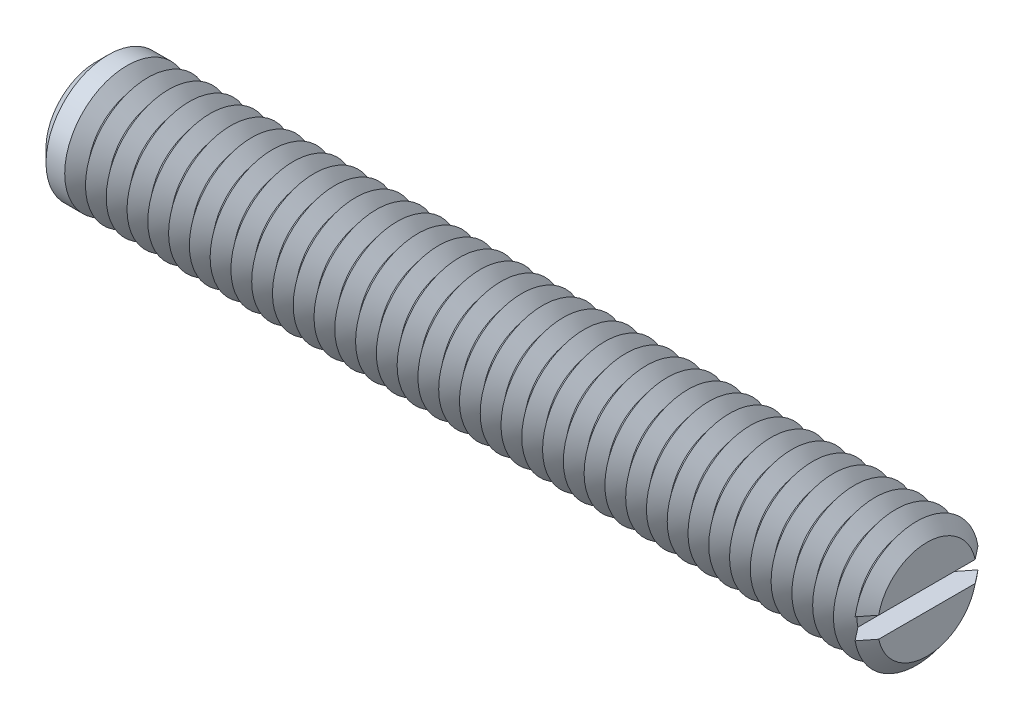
from build123d import *

# Parameters (mm, degrees)
SKETCH1_R       = 3
EXTRUDE1_DEPTH  = 20
SKETCH2_W       = 1
SKETCH2_H       = 1
EXTRUDE2_DEPTH  = 4.5
CHAMFER1_SIZE   = 0.6
LPATTERN1_COUNT = 39
LPATTERN1_PITCH = 1


with BuildPart() as part:
    # Sketch1 → Extrude1 (new, symmetric)
    with BuildSketch(Plane(origin=(0, 0, 0), x_dir=(0, 0, -1), z_dir=(1, 0, 0))):
        Circle(SKETCH1_R)
    extrude(amount=EXTRUDE1_DEPTH, both=True)

    # Sketch2 → Extrude2 (cut, symmetric)
    with BuildSketch(Plane.XY):
        with Locations((19.5, 0)):
            Rectangle(SKETCH2_W, SKETCH2_H)
    extrude(amount=EXTRUDE2_DEPTH, both=True, mode=Mode.SUBTRACT)

    # Chamfer1
    chamfer1_edges = [part.edges().sort_by_distance(p)[0] for p in [
        (-20, 0, 3),
    ]]
    chamfer(chamfer1_edges, length=CHAMFER1_SIZE)

    # Sketch3 → Cut-Revolve1 (revolve, cut)
    with BuildSketch(Plane.XY, mode=Mode.PRIVATE) as cut_revolve1_sk:
        Polygon((19.5, -3), (20.5, -3), (20, -2.3755002), align=None)
    cut_revolve1 = revolve(cut_revolve1_sk.sketch.rotate(Axis((0, 0, 0), (1, 0, 0)), 260.405931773), axis=Axis((0, 0, 0), (1, 0, 0)), mode=Mode.SUBTRACT)

    # LPattern1: Cut-Revolve1 ×39
    with Locations(*[(-i * LPATTERN1_PITCH, 0, 0) for i in range(1, LPATTERN1_COUNT)]):
        add(cut_revolve1, mode=Mode.SUBTRACT)


solid = part.part
